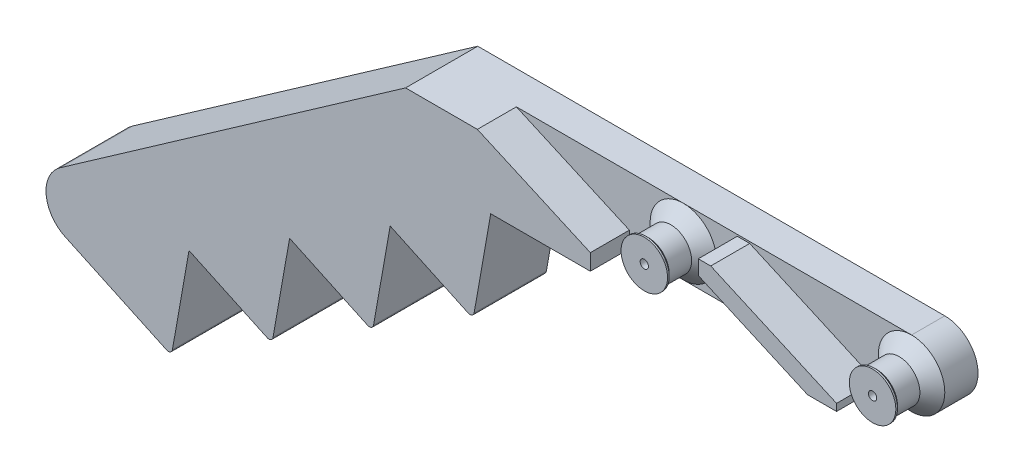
ISO-10303-21;
HEADER;
FILE_DESCRIPTION(('STEP AP214'),'2;1');
FILE_NAME('part.step','',(''),(''),'','','');
FILE_SCHEMA(('AUTOMOTIVE_DESIGN { 1 0 10303 214 1 1 1 1 }'));
ENDSEC;
DATA;
#1=APPLICATION_CONTEXT('core data for automotive mechanical design processes');
#2=APPLICATION_PROTOCOL_DEFINITION('international standard','automotive_design',2000,#1);
#3=PRODUCT_CONTEXT('',#1,'mechanical');
#4=PRODUCT('Part','Part','',(#3));
#5=PRODUCT_RELATED_PRODUCT_CATEGORY('part','',(#4));
#6=PRODUCT_DEFINITION_FORMATION('','',#4);
#7=PRODUCT_DEFINITION_CONTEXT('part definition',#1,'design');
#8=PRODUCT_DEFINITION('design','',#6,#7);
#9=PRODUCT_DEFINITION_SHAPE('','',#8);
#10=(LENGTH_UNIT() NAMED_UNIT(*) SI_UNIT(.MILLI.,.METRE.));
#11=(NAMED_UNIT(*) PLANE_ANGLE_UNIT() SI_UNIT($,.RADIAN.));
#12=(NAMED_UNIT(*) SI_UNIT($,.STERADIAN.) SOLID_ANGLE_UNIT());
#13=UNCERTAINTY_MEASURE_WITH_UNIT(LENGTH_MEASURE(1.E-05),#10,'distance_accuracy_value','');
#14=(GEOMETRIC_REPRESENTATION_CONTEXT(3) GLOBAL_UNCERTAINTY_ASSIGNED_CONTEXT((#13)) GLOBAL_UNIT_ASSIGNED_CONTEXT((#10,
#11,#12)) REPRESENTATION_CONTEXT('',''));
#15=CARTESIAN_POINT('',(0.,0.,0.));
#16=DIRECTION('',(0.,0.,1.));
#17=DIRECTION('',(1.,0.,0.));
#18=AXIS2_PLACEMENT_3D('',#15,#16,#17);
#19=CARTESIAN_POINT('',(-27.5,0.,4.));
#20=DIRECTION('',(0.,0.,1.));
#21=DIRECTION('',(1.,0.,0.));
#22=AXIS2_PLACEMENT_3D('',#19,#20,#21);
#23=PLANE('',#22);
#24=DIRECTION('',(0.,1.,0.));
#25=VECTOR('',#24,1.);
#26=CARTESIAN_POINT('',(-6.5,-3.8,4.));
#27=LINE('',#26,#25);
#28=CARTESIAN_POINT('',(-6.5,-4.,4.));
#29=VERTEX_POINT('',#28);
#30=CARTESIAN_POINT('',(-6.5,-2.0596432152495,4.));
#31=VERTEX_POINT('',#30);
#32=EDGE_CURVE('E411',#29,#31,#27,.T.);
#33=ORIENTED_EDGE('',*,*,#32,.F.);
#34=DIRECTION('',(1.,0.,0.));
#35=VECTOR('',#34,1.);
#36=CARTESIAN_POINT('',(-27.5,-4.,4.));
#37=LINE('',#36,#35);
#38=CARTESIAN_POINT('',(0.,-4.,4.));
#39=VERTEX_POINT('',#38);
#40=EDGE_CURVE('E317',#29,#39,#37,.T.);
#41=ORIENTED_EDGE('',*,*,#40,.T.);
#42=CARTESIAN_POINT('',(0.,0.,4.));
#43=DIRECTION('',(0.,0.,1.));
#44=DIRECTION('',(1.,0.,0.));
#45=AXIS2_PLACEMENT_3D('',#42,#43,#44);
#46=CIRCLE('',#45,4.);
#47=CARTESIAN_POINT('',(0.,4.,4.));
#48=VERTEX_POINT('',#47);
#49=EDGE_CURVE('E285',#48,#39,#46,.T.);
#50=ORIENTED_EDGE('',*,*,#49,.F.);
#51=DIRECTION('',(-1.,0.,0.));
#52=VECTOR('',#51,1.);
#53=CARTESIAN_POINT('',(-27.5,4.,4.));
#54=LINE('',#53,#52);
#55=CARTESIAN_POINT('',(-20.1101814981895,4.,4.));
#56=VERTEX_POINT('',#55);
#57=EDGE_CURVE('E318',#48,#56,#54,.T.);
#58=ORIENTED_EDGE('',*,*,#57,.T.);
#59=DIRECTION('',(-0.9135454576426,0.406736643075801,0.));
#60=VECTOR('',#59,1.);
#61=CARTESIAN_POINT('',(-6.5,-2.0596432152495,4.));
#62=LINE('',#61,#60);
#63=EDGE_CURVE('E435',#31,#56,#62,.T.);
#64=ORIENTED_EDGE('',*,*,#63,.F.);
#65=EDGE_LOOP('',(#33,#41,#50,#58,#64));
#66=FACE_BOUND('',#65,.T.);
#67=ADVANCED_FACE('F45',(#66),#23,.T.);
#68=CARTESIAN_POINT('',(-27.5,-4.,4.));
#69=DIRECTION('',(0.,1.,0.));
#70=DIRECTION('',(0.,0.,1.));
#71=AXIS2_PLACEMENT_3D('',#68,#69,#70);
#72=PLANE('',#71);
#73=DIRECTION('',(1.,0.,0.));
#74=VECTOR('',#73,1.);
#75=CARTESIAN_POINT('',(-27.5,-4.,0.));
#76=LINE('',#75,#74);
#77=CARTESIAN_POINT('',(-18.5,-4.,0.));
#78=VERTEX_POINT('',#77);
#79=CARTESIAN_POINT('',(27.5,-4.00000000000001,0.));
#80=VERTEX_POINT('',#79);
#81=EDGE_CURVE('E243',#78,#80,#76,.T.);
#82=ORIENTED_EDGE('',*,*,#81,.T.);
#83=DIRECTION('',(0.,0.,-1.));
#84=VECTOR('',#83,1.);
#85=CARTESIAN_POINT('',(27.5,-4.00000000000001,4.));
#86=LINE('',#85,#84);
#87=CARTESIAN_POINT('',(27.5,-4.00000000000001,4.));
#88=VERTEX_POINT('',#87);
#89=EDGE_CURVE('E271',#88,#80,#86,.T.);
#90=ORIENTED_EDGE('',*,*,#89,.F.);
#91=EDGE_CURVE('E267',#39,#88,#37,.T.);
#92=ORIENTED_EDGE('',*,*,#91,.F.);
#93=ORIENTED_EDGE('',*,*,#40,.F.);
#94=DIRECTION('',(0.,0.,-1.));
#95=VECTOR('',#94,1.);
#96=CARTESIAN_POINT('',(-6.5,-4.,86.4586234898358));
#97=LINE('',#96,#95);
#98=CARTESIAN_POINT('',(-6.5,-4.,8.7));
#99=VERTEX_POINT('',#98);
#100=EDGE_CURVE('E237',#99,#29,#97,.T.);
#101=ORIENTED_EDGE('',*,*,#100,.F.);
#102=DIRECTION('',(1.,0.,0.));
#103=VECTOR('',#102,1.);
#104=CARTESIAN_POINT('',(-6.5,-4.,8.7));
#105=LINE('',#104,#103);
#106=CARTESIAN_POINT('',(-18.5,-4.,8.7));
#107=VERTEX_POINT('',#106);
#108=EDGE_CURVE('E247',#107,#99,#105,.T.);
#109=ORIENTED_EDGE('',*,*,#108,.F.);
#110=DIRECTION('',(0.,0.,-1.));
#111=VECTOR('',#110,1.);
#112=CARTESIAN_POINT('',(-18.5,-4.,86.4586234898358));
#113=LINE('',#112,#111);
#114=EDGE_CURVE('E229',#107,#78,#113,.T.);
#115=ORIENTED_EDGE('',*,*,#114,.T.);
#116=EDGE_LOOP('',(#82,#90,#92,#93,#101,#109,#115));
#117=FACE_BOUND('',#116,.T.);
#118=ADVANCED_FACE('F241',(#117),#72,.F.);
#119=DIRECTION('',(1.,0.,0.));
#120=VECTOR('',#119,1.);
#121=CARTESIAN_POINT('',(19.6609741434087,-3.8,4.));
#122=LINE('',#121,#120);
#123=CARTESIAN_POINT('',(19.6609741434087,-3.8,4.));
#124=VERTEX_POINT('',#123);
#125=CARTESIAN_POINT('',(23.1609741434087,-3.8,4.));
#126=VERTEX_POINT('',#125);
#127=EDGE_CURVE('E396',#124,#126,#122,.T.);
#128=ORIENTED_EDGE('',*,*,#127,.F.);
#129=DIRECTION('',(0.9135454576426,-0.406736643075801,0.));
#130=VECTOR('',#129,1.);
#131=CARTESIAN_POINT('',(6.5,2.0596432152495,4.));
#132=LINE('',#131,#130);
#133=CARTESIAN_POINT('',(6.5,2.0596432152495,4.));
#134=VERTEX_POINT('',#133);
#135=EDGE_CURVE('E63',#134,#124,#132,.T.);
#136=ORIENTED_EDGE('',*,*,#135,.F.);
#137=DIRECTION('',(0.,-1.,0.));
#138=VECTOR('',#137,1.);
#139=CARTESIAN_POINT('',(6.5,3.8,4.));
#140=LINE('',#139,#138);
#141=CARTESIAN_POINT('',(6.5,3.8,4.));
#142=VERTEX_POINT('',#141);
#143=EDGE_CURVE('E68',#142,#134,#140,.T.);
#144=ORIENTED_EDGE('',*,*,#143,.F.);
#145=DIRECTION('',(-1.,0.,0.));
#146=VECTOR('',#145,1.);
#147=CARTESIAN_POINT('',(8.,3.8,4.));
#148=LINE('',#147,#146);
#149=CARTESIAN_POINT('',(8.,3.8,4.));
#150=VERTEX_POINT('',#149);
#151=EDGE_CURVE('E404',#150,#142,#148,.T.);
#152=ORIENTED_EDGE('',*,*,#151,.F.);
#153=DIRECTION('',(-0.9135454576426,0.406736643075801,0.));
#154=VECTOR('',#153,1.);
#155=CARTESIAN_POINT('',(23.1609741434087,-2.95010058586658,4.));
#156=LINE('',#155,#154);
#157=CARTESIAN_POINT('',(23.1609741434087,-2.95010058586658,4.));
#158=VERTEX_POINT('',#157);
#159=EDGE_CURVE('E388',#158,#150,#156,.T.);
#160=ORIENTED_EDGE('',*,*,#159,.F.);
#161=DIRECTION('',(0.,1.,0.));
#162=VECTOR('',#161,1.);
#163=CARTESIAN_POINT('',(23.1609741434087,-3.8,4.));
#164=LINE('',#163,#162);
#165=EDGE_CURVE('E392',#126,#158,#164,.T.);
#166=ORIENTED_EDGE('',*,*,#165,.F.);
#167=EDGE_LOOP('',(#128,#136,#144,#152,#160,#166));
#168=FACE_BOUND('',#167,.T.);
#169=ORIENTED_EDGE('',*,*,#91,.T.);
#170=CARTESIAN_POINT('',(27.5,0.,4.));
#171=DIRECTION('',(0.,0.,1.));
#172=DIRECTION('',(1.,0.,0.));
#173=AXIS2_PLACEMENT_3D('',#170,#171,#172);
#174=CIRCLE('',#173,4.);
#175=CARTESIAN_POINT('',(27.5,4.,4.));
#176=VERTEX_POINT('',#175);
#177=EDGE_CURVE('E273',#176,#88,#174,.T.);
#178=ORIENTED_EDGE('',*,*,#177,.F.);
#179=EDGE_CURVE('E263',#176,#48,#54,.T.);
#180=ORIENTED_EDGE('',*,*,#179,.T.);
#181=CARTESIAN_POINT('',(0.,0.,4.));
#182=DIRECTION('',(0.,0.,-1.));
#183=DIRECTION('',(-1.,0.,0.));
#184=AXIS2_PLACEMENT_3D('',#181,#182,#183);
#185=CIRCLE('',#184,4.);
#186=EDGE_CURVE('E313',#48,#39,#185,.T.);
#187=ORIENTED_EDGE('',*,*,#186,.T.);
#188=EDGE_LOOP('',(#169,#178,#180,#187));
#189=FACE_BOUND('',#188,.T.);
#190=ADVANCED_FACE('F326',(#168,#189),#23,.T.);
#191=CARTESIAN_POINT('',(27.5,0.,4.));
#192=DIRECTION('',(0.,0.,-1.));
#193=DIRECTION('',(-1.,0.,0.));
#194=AXIS2_PLACEMENT_3D('',#191,#192,#193);
#195=CYLINDRICAL_SURFACE('',#194,4.00000000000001);
#196=DIRECTION('',(0.,0.,-1.));
#197=VECTOR('',#196,1.);
#198=CARTESIAN_POINT('',(27.5,4.00000000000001,4.));
#199=LINE('',#198,#197);
#200=CARTESIAN_POINT('',(27.5,4.00000000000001,0.));
#201=VERTEX_POINT('',#200);
#202=EDGE_CURVE('E268',#176,#201,#199,.T.);
#203=ORIENTED_EDGE('',*,*,#202,.F.);
#204=CARTESIAN_POINT('',(27.5,0.,3.99999999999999));
#205=DIRECTION('',(0.,0.,1.));
#206=DIRECTION('',(1.,0.,0.));
#207=AXIS2_PLACEMENT_3D('',#204,#205,#206);
#208=CIRCLE('',#207,4.00000000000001);
#209=EDGE_CURVE('E276',#176,#88,#208,.F.);
#210=ORIENTED_EDGE('',*,*,#209,.T.);
#211=ORIENTED_EDGE('',*,*,#89,.T.);
#212=CARTESIAN_POINT('',(27.5,0.,0.));
#213=DIRECTION('',(0.,0.,1.));
#214=DIRECTION('',(1.,0.,0.));
#215=AXIS2_PLACEMENT_3D('',#212,#213,#214);
#216=CIRCLE('',#215,4.00000000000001);
#217=EDGE_CURVE('E254',#80,#201,#216,.T.);
#218=ORIENTED_EDGE('',*,*,#217,.T.);
#219=EDGE_LOOP('',(#203,#210,#211,#218));
#220=FACE_BOUND('',#219,.T.);
#221=ADVANCED_FACE('F333',(#220),#195,.T.);
#222=CARTESIAN_POINT('',(-27.5,4.,4.));
#223=DIRECTION('',(0.,-1.,0.));
#224=DIRECTION('',(1.,0.,0.));
#225=AXIS2_PLACEMENT_3D('',#222,#223,#224);
#226=PLANE('',#225);
#227=DIRECTION('',(0.,0.,-1.));
#228=VECTOR('',#227,1.);
#229=CARTESIAN_POINT('',(-20.1101814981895,4.,86.4586234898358));
#230=LINE('',#229,#228);
#231=CARTESIAN_POINT('',(-20.1101814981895,4.,8.7));
#232=VERTEX_POINT('',#231);
#233=EDGE_CURVE('E357',#232,#56,#230,.T.);
#234=ORIENTED_EDGE('',*,*,#233,.T.);
#235=ORIENTED_EDGE('',*,*,#57,.F.);
#236=ORIENTED_EDGE('',*,*,#179,.F.);
#237=ORIENTED_EDGE('',*,*,#202,.T.);
#238=DIRECTION('',(-1.,0.,0.));
#239=VECTOR('',#238,1.);
#240=CARTESIAN_POINT('',(-27.5,4.,0.));
#241=LINE('',#240,#239);
#242=CARTESIAN_POINT('',(-28.7611951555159,4.,0.));
#243=VERTEX_POINT('',#242);
#244=EDGE_CURVE('E257',#201,#243,#241,.T.);
#245=ORIENTED_EDGE('',*,*,#244,.T.);
#246=DIRECTION('',(0.,0.,-1.));
#247=VECTOR('',#246,1.);
#248=CARTESIAN_POINT('',(-28.7611951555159,4.,86.4586234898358));
#249=LINE('',#248,#247);
#250=CARTESIAN_POINT('',(-28.7611951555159,4.,8.7));
#251=VERTEX_POINT('',#250);
#252=EDGE_CURVE('E350',#251,#243,#249,.T.);
#253=ORIENTED_EDGE('',*,*,#252,.F.);
#254=DIRECTION('',(-1.,0.,0.));
#255=VECTOR('',#254,1.);
#256=CARTESIAN_POINT('',(-20.1101814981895,4.,8.7));
#257=LINE('',#256,#255);
#258=EDGE_CURVE('E450',#232,#251,#257,.T.);
#259=ORIENTED_EDGE('',*,*,#258,.F.);
#260=EDGE_LOOP('',(#234,#235,#236,#237,#245,#253,#259));
#261=FACE_BOUND('',#260,.T.);
#262=ADVANCED_FACE('F336',(#261),#226,.F.);
#263=CARTESIAN_POINT('',(-27.5,0.,0.));
#264=DIRECTION('',(0.,0.,1.));
#265=DIRECTION('',(1.,0.,0.));
#266=AXIS2_PLACEMENT_3D('',#263,#264,#265);
#267=PLANE('',#266);
#268=ORIENTED_EDGE('',*,*,#217,.F.);
#269=ORIENTED_EDGE('',*,*,#81,.F.);
#270=DIRECTION('',(-0.173648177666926,-0.984807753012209,0.));
#271=VECTOR('',#270,1.);
#272=CARTESIAN_POINT('',(-18.5,-4.,0.));
#273=LINE('',#272,#271);
#274=CARTESIAN_POINT('',(-20.5027724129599,-15.3582867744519,0.));
#275=VERTEX_POINT('',#274);
#276=EDGE_CURVE('E226',#78,#275,#273,.T.);
#277=ORIENTED_EDGE('',*,*,#276,.T.);
#278=CARTESIAN_POINT('',(-20.995176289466,-15.2714626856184,0.));
#279=DIRECTION('',(0.,0.,1.));
#280=DIRECTION('',(1.,0.,0.));
#281=AXIS2_PLACEMENT_3D('',#278,#279,#280);
#282=CIRCLE('',#281,0.499999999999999);
#283=CARTESIAN_POINT('',(-21.2064854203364,-15.7246165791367,0.));
#284=VERTEX_POINT('',#283);
#285=EDGE_CURVE('E238',#275,#284,#282,.F.);
#286=ORIENTED_EDGE('',*,*,#285,.T.);
#287=DIRECTION('',(-0.90630778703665,0.4226182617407,0.));
#288=VECTOR('',#287,1.);
#289=CARTESIAN_POINT('',(-21.2064854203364,-15.7246165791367,0.));
#290=LINE('',#289,#288);
#291=CARTESIAN_POINT('',(-30.6159237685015,-11.33692341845,0.));
#292=VERTEX_POINT('',#291);
#293=EDGE_CURVE('E947',#284,#292,#290,.T.);
#294=ORIENTED_EDGE('',*,*,#293,.T.);
#295=DIRECTION('',(-0.173648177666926,-0.984807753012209,0.));
#296=VECTOR('',#295,1.);
#297=CARTESIAN_POINT('',(-30.6159237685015,-11.33692341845,0.));
#298=LINE('',#297,#296);
#299=CARTESIAN_POINT('',(-32.6186961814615,-22.6952101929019,0.));
#300=VERTEX_POINT('',#299);
#301=EDGE_CURVE('E950',#292,#300,#298,.T.);
#302=ORIENTED_EDGE('',*,*,#301,.T.);
#303=CARTESIAN_POINT('',(-33.1111000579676,-22.6083861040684,0.));
#304=DIRECTION('',(0.,0.,1.));
#305=DIRECTION('',(1.,0.,0.));
#306=AXIS2_PLACEMENT_3D('',#303,#304,#305);
#307=CIRCLE('',#306,0.499999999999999);
#308=CARTESIAN_POINT('',(-33.3224091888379,-23.0615399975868,0.));
#309=VERTEX_POINT('',#308);
#310=EDGE_CURVE('E953',#300,#309,#307,.F.);
#311=ORIENTED_EDGE('',*,*,#310,.T.);
#312=DIRECTION('',(-0.90630778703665,0.4226182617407,0.));
#313=VECTOR('',#312,1.);
#314=CARTESIAN_POINT('',(-33.3224091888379,-23.0615399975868,0.));
#315=LINE('',#314,#313);
#316=CARTESIAN_POINT('',(-42.7318475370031,-18.6738468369,0.));
#317=VERTEX_POINT('',#316);
#318=EDGE_CURVE('E956',#309,#317,#315,.T.);
#319=ORIENTED_EDGE('',*,*,#318,.T.);
#320=DIRECTION('',(-0.173648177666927,-0.984807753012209,0.));
#321=VECTOR('',#320,1.);
#322=CARTESIAN_POINT('',(-42.7318475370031,-18.6738468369,0.));
#323=LINE('',#322,#321);
#324=CARTESIAN_POINT('',(-44.734619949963,-30.0321336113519,0.));
#325=VERTEX_POINT('',#324);
#326=EDGE_CURVE('E959',#317,#325,#323,.T.);
#327=ORIENTED_EDGE('',*,*,#326,.T.);
#328=CARTESIAN_POINT('',(-45.2270238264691,-29.9453095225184,0.));
#329=DIRECTION('',(0.,0.,1.));
#330=DIRECTION('',(1.,0.,0.));
#331=AXIS2_PLACEMENT_3D('',#328,#329,#330);
#332=CIRCLE('',#331,0.499999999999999);
#333=CARTESIAN_POINT('',(-45.4383329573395,-30.3984634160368,0.));
#334=VERTEX_POINT('',#333);
#335=EDGE_CURVE('E962',#325,#334,#332,.F.);
#336=ORIENTED_EDGE('',*,*,#335,.T.);
#337=DIRECTION('',(-0.90630778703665,0.4226182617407,0.));
#338=VECTOR('',#337,1.);
#339=CARTESIAN_POINT('',(-45.4383329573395,-30.3984634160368,0.));
#340=LINE('',#339,#338);
#341=CARTESIAN_POINT('',(-54.8477713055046,-26.01077025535,0.));
#342=VERTEX_POINT('',#341);
#343=EDGE_CURVE('E965',#334,#342,#340,.T.);
#344=ORIENTED_EDGE('',*,*,#343,.T.);
#345=DIRECTION('',(-0.173648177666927,-0.984807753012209,0.));
#346=VECTOR('',#345,1.);
#347=CARTESIAN_POINT('',(-54.8477713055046,-26.01077025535,0.));
#348=LINE('',#347,#346);
#349=CARTESIAN_POINT('',(-56.8505437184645,-37.3690570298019,0.));
#350=VERTEX_POINT('',#349);
#351=EDGE_CURVE('E968',#342,#350,#348,.T.);
#352=ORIENTED_EDGE('',*,*,#351,.T.);
#353=CARTESIAN_POINT('',(-57.3429475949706,-37.2822329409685,0.));
#354=DIRECTION('',(0.,0.,1.));
#355=DIRECTION('',(1.,0.,0.));
#356=AXIS2_PLACEMENT_3D('',#353,#354,#355);
#357=CIRCLE('',#356,0.500000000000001);
#358=CARTESIAN_POINT('',(-57.554256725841,-37.7353868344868,0.));
#359=VERTEX_POINT('',#358);
#360=EDGE_CURVE('E971',#350,#359,#357,.F.);
#361=ORIENTED_EDGE('',*,*,#360,.T.);
#362=DIRECTION('',(-0.90630778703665,0.4226182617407,0.));
#363=VECTOR('',#362,1.);
#364=CARTESIAN_POINT('',(-57.554256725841,-37.7353868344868,0.));
#365=LINE('',#364,#363);
#366=CARTESIAN_POINT('',(-69.7698031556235,-32.0391839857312,0.));
#367=VERTEX_POINT('',#366);
#368=EDGE_CURVE('E974',#359,#367,#365,.T.);
#369=ORIENTED_EDGE('',*,*,#368,.T.);
#370=CARTESIAN_POINT('',(-68.0793301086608,-28.4139528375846,0.));
#371=DIRECTION('',(0.,0.,1.));
#372=DIRECTION('',(1.,0.,0.));
#373=AXIS2_PLACEMENT_3D('',#370,#371,#372);
#374=CIRCLE('',#373,4.);
#375=CARTESIAN_POINT('',(-70.3736358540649,-25.1373446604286,0.));
#376=VERTEX_POINT('',#375);
#377=EDGE_CURVE('E345',#367,#376,#374,.F.);
#378=ORIENTED_EDGE('',*,*,#377,.T.);
#379=DIRECTION('',(0.819152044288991,0.573576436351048,0.));
#380=VECTOR('',#379,1.);
#381=CARTESIAN_POINT('',(-28.7611951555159,4.,0.));
#382=LINE('',#381,#380);
#383=EDGE_CURVE('E341',#376,#243,#382,.T.);
#384=ORIENTED_EDGE('',*,*,#383,.T.);
#385=ORIENTED_EDGE('',*,*,#244,.F.);
#386=EDGE_LOOP('',(#268,#269,#277,#286,#294,#302,#311,#319,#327,#336,#344,#352,#361,#369,#378,
#384,#385));
#387=FACE_BOUND('',#386,.T.);
#388=CARTESIAN_POINT('',(0.,0.,0.));
#389=DIRECTION('',(0.,0.,-1.));
#390=DIRECTION('',(-1.,0.,0.));
#391=AXIS2_PLACEMENT_3D('',#388,#389,#390);
#392=CIRCLE('',#391,0.5);
#393=CARTESIAN_POINT('',(-0.5,0.,0.));
#394=VERTEX_POINT('',#393);
#395=EDGE_CURVE('E297',#394,#394,#392,.T.);
#396=ORIENTED_EDGE('',*,*,#395,.F.);
#397=EDGE_LOOP('',(#396));
#398=FACE_BOUND('',#397,.T.);
#399=CARTESIAN_POINT('',(27.5,0.,0.));
#400=DIRECTION('',(0.,0.,-1.));
#401=DIRECTION('',(-1.,0.,0.));
#402=AXIS2_PLACEMENT_3D('',#399,#400,#401);
#403=CIRCLE('',#402,0.499999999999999);
#404=CARTESIAN_POINT('',(27.,0.,0.));
#405=VERTEX_POINT('',#404);
#406=EDGE_CURVE('E291',#405,#405,#403,.T.);
#407=ORIENTED_EDGE('',*,*,#406,.F.);
#408=EDGE_LOOP('',(#407));
#409=FACE_BOUND('',#408,.T.);
#410=ADVANCED_FACE('F251',(#387,#398,#409),#267,.F.);
#411=CARTESIAN_POINT('',(27.5,0.,7.5));
#412=DIRECTION('',(0.,0.,-1.));
#413=DIRECTION('',(-1.,0.,0.));
#414=AXIS2_PLACEMENT_3D('',#411,#412,#413);
#415=CYLINDRICAL_SURFACE('',#414,2.50000000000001);
#416=CARTESIAN_POINT('',(27.5,0.,8.20000000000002));
#417=DIRECTION('',(0.,0.,1.));
#418=DIRECTION('',(1.,0.,0.));
#419=AXIS2_PLACEMENT_3D('',#416,#417,#418);
#420=CIRCLE('',#419,2.50000000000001);
#421=CARTESIAN_POINT('',(30.,0.,8.20000000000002));
#422=VERTEX_POINT('',#421);
#423=EDGE_CURVE('E282',#422,#422,#420,.F.);
#424=ORIENTED_EDGE('',*,*,#423,.T.);
#425=EDGE_LOOP('',(#424));
#426=FACE_BOUND('',#425,.T.);
#427=CARTESIAN_POINT('',(27.5,0.,5.5));
#428=DIRECTION('',(0.,0.,-1.));
#429=DIRECTION('',(-1.,0.,0.));
#430=AXIS2_PLACEMENT_3D('',#427,#428,#429);
#431=CIRCLE('',#430,2.50000000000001);
#432=CARTESIAN_POINT('',(25.,0.,5.5));
#433=VERTEX_POINT('',#432);
#434=EDGE_CURVE('E255',#433,#433,#431,.T.);
#435=ORIENTED_EDGE('',*,*,#434,.F.);
#436=EDGE_LOOP('',(#435));
#437=FACE_BOUND('',#436,.T.);
#438=ADVANCED_FACE('F537',(#426,#437),#415,.T.);
#439=CARTESIAN_POINT('',(27.5,0.,8.7));
#440=DIRECTION('',(0.,0.,-1.));
#441=DIRECTION('',(-1.,0.,0.));
#442=AXIS2_PLACEMENT_3D('',#439,#440,#441);
#443=CYLINDRICAL_SURFACE('',#442,2.8);
#444=CARTESIAN_POINT('',(27.5,0.,8.50000000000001));
#445=DIRECTION('',(0.,0.,1.));
#446=DIRECTION('',(1.,0.,0.));
#447=AXIS2_PLACEMENT_3D('',#444,#445,#446);
#448=CIRCLE('',#447,2.8);
#449=CARTESIAN_POINT('',(30.3,0.,8.50000000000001));
#450=VERTEX_POINT('',#449);
#451=EDGE_CURVE('E279',#450,#450,#448,.T.);
#452=ORIENTED_EDGE('',*,*,#451,.T.);
#453=EDGE_LOOP('',(#452));
#454=FACE_BOUND('',#453,.T.);
#455=CARTESIAN_POINT('',(27.5,0.,8.7));
#456=DIRECTION('',(0.,0.,-1.));
#457=DIRECTION('',(-1.,0.,0.));
#458=AXIS2_PLACEMENT_3D('',#455,#456,#457);
#459=CIRCLE('',#458,2.8);
#460=CARTESIAN_POINT('',(24.7,0.,8.7));
#461=VERTEX_POINT('',#460);
#462=EDGE_CURVE('E260',#461,#461,#459,.T.);
#463=ORIENTED_EDGE('',*,*,#462,.T.);
#464=EDGE_LOOP('',(#463));
#465=FACE_BOUND('',#464,.T.);
#466=ADVANCED_FACE('F533',(#454,#465),#443,.T.);
#467=CARTESIAN_POINT('',(27.5,0.,8.7));
#468=DIRECTION('',(0.,0.,1.));
#469=DIRECTION('',(-1.,0.,0.));
#470=AXIS2_PLACEMENT_3D('',#467,#468,#469);
#471=PLANE('',#470);
#472=CARTESIAN_POINT('',(27.5,0.,8.7));
#473=DIRECTION('',(0.,0.,1.));
#474=DIRECTION('',(1.,0.,0.));
#475=AXIS2_PLACEMENT_3D('',#472,#473,#474);
#476=CIRCLE('',#475,0.499999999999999);
#477=CARTESIAN_POINT('',(28.,0.,8.7));
#478=VERTEX_POINT('',#477);
#479=EDGE_CURVE('E50',#478,#478,#476,.T.);
#480=ORIENTED_EDGE('',*,*,#479,.F.);
#481=EDGE_LOOP('',(#480));
#482=FACE_BOUND('',#481,.T.);
#483=ORIENTED_EDGE('',*,*,#462,.F.);
#484=EDGE_LOOP('',(#483));
#485=FACE_BOUND('',#484,.T.);
#486=ADVANCED_FACE('F531',(#482,#485),#471,.T.);
#487=CARTESIAN_POINT('',(27.5,0.,3.99999999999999));
#488=DIRECTION('',(0.,0.,-1.));
#489=DIRECTION('',(-1.,0.,0.));
#490=AXIS2_PLACEMENT_3D('',#487,#488,#489);
#491=CONICAL_SURFACE('',#490,4.00000000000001,0.785398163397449);
#492=ORIENTED_EDGE('',*,*,#434,.T.);
#493=EDGE_LOOP('',(#492));
#494=FACE_BOUND('',#493,.T.);
#495=ORIENTED_EDGE('',*,*,#177,.T.);
#496=ORIENTED_EDGE('',*,*,#209,.F.);
#497=EDGE_LOOP('',(#495,#496));
#498=FACE_BOUND('',#497,.T.);
#499=ADVANCED_FACE('F330',(#494,#498),#491,.T.);
#500=CARTESIAN_POINT('',(27.5,0.,7.5));
#501=DIRECTION('',(0.,0.,1.));
#502=DIRECTION('',(1.,0.,0.));
#503=AXIS2_PLACEMENT_3D('',#500,#501,#502);
#504=CONICAL_SURFACE('',#503,1.79999999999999,0.785398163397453);
#505=ORIENTED_EDGE('',*,*,#451,.F.);
#506=EDGE_LOOP('',(#505));
#507=FACE_BOUND('',#506,.T.);
#508=ORIENTED_EDGE('',*,*,#423,.F.);
#509=EDGE_LOOP('',(#508));
#510=FACE_BOUND('',#509,.T.);
#511=ADVANCED_FACE('F529',(#507,#510),#504,.T.);
#512=CARTESIAN_POINT('',(0.,0.,7.5));
#513=DIRECTION('',(0.,0.,-1.));
#514=DIRECTION('',(-1.,0.,0.));
#515=AXIS2_PLACEMENT_3D('',#512,#513,#514);
#516=CYLINDRICAL_SURFACE('',#515,2.50000000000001);
#517=CARTESIAN_POINT('',(0.,0.,8.20000000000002));
#518=DIRECTION('',(0.,0.,1.));
#519=DIRECTION('',(1.,0.,0.));
#520=AXIS2_PLACEMENT_3D('',#517,#518,#519);
#521=CIRCLE('',#520,2.50000000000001);
#522=CARTESIAN_POINT('',(2.50000000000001,0.,8.20000000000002));
#523=VERTEX_POINT('',#522);
#524=EDGE_CURVE('E11',#523,#523,#521,.F.);
#525=ORIENTED_EDGE('',*,*,#524,.T.);
#526=EDGE_LOOP('',(#525));
#527=FACE_BOUND('',#526,.T.);
#528=CARTESIAN_POINT('',(0.,0.,5.5));
#529=DIRECTION('',(0.,0.,-1.));
#530=DIRECTION('',(-1.,0.,0.));
#531=AXIS2_PLACEMENT_3D('',#528,#529,#530);
#532=CIRCLE('',#531,2.50000000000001);
#533=CARTESIAN_POINT('',(-2.50000000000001,0.,5.5));
#534=VERTEX_POINT('',#533);
#535=EDGE_CURVE('E310',#534,#534,#532,.T.);
#536=ORIENTED_EDGE('',*,*,#535,.F.);
#537=EDGE_LOOP('',(#536));
#538=FACE_BOUND('',#537,.T.);
#539=ADVANCED_FACE('F525',(#527,#538),#516,.T.);
#540=CARTESIAN_POINT('',(0.,0.,8.7));
#541=DIRECTION('',(0.,0.,-1.));
#542=DIRECTION('',(-1.,0.,0.));
#543=AXIS2_PLACEMENT_3D('',#540,#541,#542);
#544=CYLINDRICAL_SURFACE('',#543,2.8);
#545=CARTESIAN_POINT('',(0.,0.,8.50000000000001));
#546=DIRECTION('',(0.,0.,1.));
#547=DIRECTION('',(1.,0.,0.));
#548=AXIS2_PLACEMENT_3D('',#545,#546,#547);
#549=CIRCLE('',#548,2.8);
#550=CARTESIAN_POINT('',(2.8,0.,8.50000000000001));
#551=VERTEX_POINT('',#550);
#552=EDGE_CURVE('E55',#551,#551,#549,.T.);
#553=ORIENTED_EDGE('',*,*,#552,.T.);
#554=EDGE_LOOP('',(#553));
#555=FACE_BOUND('',#554,.T.);
#556=CARTESIAN_POINT('',(0.,0.,8.7));
#557=DIRECTION('',(0.,0.,-1.));
#558=DIRECTION('',(-1.,0.,0.));
#559=AXIS2_PLACEMENT_3D('',#556,#557,#558);
#560=CIRCLE('',#559,2.8);
#561=CARTESIAN_POINT('',(-2.8,0.,8.7));
#562=VERTEX_POINT('',#561);
#563=EDGE_CURVE('E295',#562,#562,#560,.T.);
#564=ORIENTED_EDGE('',*,*,#563,.T.);
#565=EDGE_LOOP('',(#564));
#566=FACE_BOUND('',#565,.T.);
#567=ADVANCED_FACE('F521',(#555,#566),#544,.T.);
#568=CARTESIAN_POINT('',(0.,0.,8.7));
#569=DIRECTION('',(0.,0.,1.));
#570=DIRECTION('',(-1.,0.,0.));
#571=AXIS2_PLACEMENT_3D('',#568,#569,#570);
#572=PLANE('',#571);
#573=CARTESIAN_POINT('',(0.,0.,8.7));
#574=DIRECTION('',(0.,0.,1.));
#575=DIRECTION('',(1.,0.,0.));
#576=AXIS2_PLACEMENT_3D('',#573,#574,#575);
#577=CIRCLE('',#576,0.5);
#578=CARTESIAN_POINT('',(0.5,0.,8.7));
#579=VERTEX_POINT('',#578);
#580=EDGE_CURVE('E289',#579,#579,#577,.T.);
#581=ORIENTED_EDGE('',*,*,#580,.F.);
#582=EDGE_LOOP('',(#581));
#583=FACE_BOUND('',#582,.T.);
#584=ORIENTED_EDGE('',*,*,#563,.F.);
#585=EDGE_LOOP('',(#584));
#586=FACE_BOUND('',#585,.T.);
#587=ADVANCED_FACE('F463',(#583,#586),#572,.T.);
#588=CARTESIAN_POINT('',(0.,0.,7.5));
#589=DIRECTION('',(0.,0.,1.));
#590=DIRECTION('',(1.,0.,0.));
#591=AXIS2_PLACEMENT_3D('',#588,#589,#590);
#592=CONICAL_SURFACE('',#591,1.79999999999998,0.785398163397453);
#593=ORIENTED_EDGE('',*,*,#552,.F.);
#594=EDGE_LOOP('',(#593));
#595=FACE_BOUND('',#594,.T.);
#596=ORIENTED_EDGE('',*,*,#524,.F.);
#597=EDGE_LOOP('',(#596));
#598=FACE_BOUND('',#597,.T.);
#599=ADVANCED_FACE('F454',(#595,#598),#592,.T.);
#600=CARTESIAN_POINT('',(0.,0.,4.00000000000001));
#601=DIRECTION('',(0.,0.,-1.));
#602=DIRECTION('',(-1.,0.,0.));
#603=AXIS2_PLACEMENT_3D('',#600,#601,#602);
#604=CONICAL_SURFACE('',#603,4.,0.785398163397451);
#605=ORIENTED_EDGE('',*,*,#535,.T.);
#606=EDGE_LOOP('',(#605));
#607=FACE_BOUND('',#606,.T.);
#608=ORIENTED_EDGE('',*,*,#49,.T.);
#609=ORIENTED_EDGE('',*,*,#186,.F.);
#610=EDGE_LOOP('',(#608,#609));
#611=FACE_BOUND('',#610,.T.);
#612=ADVANCED_FACE('F48',(#607,#611),#604,.T.);
#613=CARTESIAN_POINT('',(0.,0.,9.5));
#614=DIRECTION('',(0.,0.,-1.));
#615=DIRECTION('',(-1.,0.,0.));
#616=AXIS2_PLACEMENT_3D('',#613,#614,#615);
#617=CYLINDRICAL_SURFACE('',#616,0.5);
#618=ORIENTED_EDGE('',*,*,#580,.T.);
#619=EDGE_LOOP('',(#618));
#620=FACE_BOUND('',#619,.T.);
#621=ORIENTED_EDGE('',*,*,#395,.T.);
#622=EDGE_LOOP('',(#621));
#623=FACE_BOUND('',#622,.T.);
#624=ADVANCED_FACE('F453',(#620,#623),#617,.F.);
#625=CARTESIAN_POINT('',(27.5,0.,9.5));
#626=DIRECTION('',(0.,0.,-1.));
#627=DIRECTION('',(-1.,0.,0.));
#628=AXIS2_PLACEMENT_3D('',#625,#626,#627);
#629=CYLINDRICAL_SURFACE('',#628,0.499999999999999);
#630=ORIENTED_EDGE('',*,*,#479,.T.);
#631=EDGE_LOOP('',(#630));
#632=FACE_BOUND('',#631,.T.);
#633=ORIENTED_EDGE('',*,*,#406,.T.);
#634=EDGE_LOOP('',(#633));
#635=FACE_BOUND('',#634,.T.);
#636=ADVANCED_FACE('F461',(#632,#635),#629,.F.);
#637=CARTESIAN_POINT('',(-6.5,-3.8,27.0125110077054));
#638=DIRECTION('',(-1.,0.,0.));
#639=DIRECTION('',(0.,0.,1.));
#640=AXIS2_PLACEMENT_3D('',#637,#638,#639);
#641=PLANE('',#640);
#642=DIRECTION('',(0.,1.,0.));
#643=VECTOR('',#642,1.);
#644=CARTESIAN_POINT('',(-6.5,-3.8,8.7));
#645=LINE('',#644,#643);
#646=CARTESIAN_POINT('',(-6.5,-2.0596432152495,8.70000000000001));
#647=VERTEX_POINT('',#646);
#648=EDGE_CURVE('E437',#99,#647,#645,.T.);
#649=ORIENTED_EDGE('',*,*,#648,.F.);
#650=ORIENTED_EDGE('',*,*,#100,.T.);
#651=ORIENTED_EDGE('',*,*,#32,.T.);
#652=DIRECTION('',(0.,0.,-1.));
#653=VECTOR('',#652,1.);
#654=CARTESIAN_POINT('',(-6.5,-2.0596432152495,27.0125110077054));
#655=LINE('',#654,#653);
#656=EDGE_CURVE('E305',#647,#31,#655,.T.);
#657=ORIENTED_EDGE('',*,*,#656,.F.);
#658=EDGE_LOOP('',(#649,#650,#651,#657));
#659=FACE_BOUND('',#658,.T.);
#660=ADVANCED_FACE('F445',(#659),#641,.F.);
#661=CARTESIAN_POINT('',(-6.5,-2.0596432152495,27.0125110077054));
#662=DIRECTION('',(-0.406736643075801,-0.913545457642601,0.));
#663=DIRECTION('',(0.913545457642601,-0.406736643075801,0.));
#664=AXIS2_PLACEMENT_3D('',#661,#662,#663);
#665=PLANE('',#664);
#666=ORIENTED_EDGE('',*,*,#63,.T.);
#667=ORIENTED_EDGE('',*,*,#233,.F.);
#668=DIRECTION('',(-0.913545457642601,0.406736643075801,0.));
#669=VECTOR('',#668,1.);
#670=CARTESIAN_POINT('',(-6.5,-2.0596432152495,8.7));
#671=LINE('',#670,#669);
#672=EDGE_CURVE('E302',#647,#232,#671,.T.);
#673=ORIENTED_EDGE('',*,*,#672,.F.);
#674=ORIENTED_EDGE('',*,*,#656,.T.);
#675=EDGE_LOOP('',(#666,#667,#673,#674));
#676=FACE_BOUND('',#675,.T.);
#677=ADVANCED_FACE('F448',(#676),#665,.F.);
#678=CARTESIAN_POINT('',(27.5,0.,8.7));
#679=DIRECTION('',(0.,0.,1.));
#680=DIRECTION('',(-1.,0.,0.));
#681=AXIS2_PLACEMENT_3D('',#678,#679,#680);
#682=PLANE('',#681);
#683=DIRECTION('',(0.913545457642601,-0.406736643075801,0.));
#684=VECTOR('',#683,1.);
#685=CARTESIAN_POINT('',(6.5,2.0596432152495,8.7));
#686=LINE('',#685,#684);
#687=CARTESIAN_POINT('',(6.5,2.0596432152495,8.70000000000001));
#688=VERTEX_POINT('',#687);
#689=CARTESIAN_POINT('',(19.6609741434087,-3.8,8.70000000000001));
#690=VERTEX_POINT('',#689);
#691=EDGE_CURVE('E415',#688,#690,#686,.T.);
#692=ORIENTED_EDGE('',*,*,#691,.T.);
#693=DIRECTION('',(1.,0.,0.));
#694=VECTOR('',#693,1.);
#695=CARTESIAN_POINT('',(19.6609741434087,-3.8,8.7));
#696=LINE('',#695,#694);
#697=CARTESIAN_POINT('',(23.1609741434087,-3.8,8.70000000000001));
#698=VERTEX_POINT('',#697);
#699=EDGE_CURVE('E412',#690,#698,#696,.T.);
#700=ORIENTED_EDGE('',*,*,#699,.T.);
#701=DIRECTION('',(0.,1.,0.));
#702=VECTOR('',#701,1.);
#703=CARTESIAN_POINT('',(23.1609741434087,-3.8,8.7));
#704=LINE('',#703,#702);
#705=CARTESIAN_POINT('',(23.1609741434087,-2.95010058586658,8.70000000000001));
#706=VERTEX_POINT('',#705);
#707=EDGE_CURVE('E408',#698,#706,#704,.T.);
#708=ORIENTED_EDGE('',*,*,#707,.T.);
#709=DIRECTION('',(-0.9135454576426,0.406736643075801,0.));
#710=VECTOR('',#709,1.);
#711=CARTESIAN_POINT('',(23.1609741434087,-2.95010058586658,8.7));
#712=LINE('',#711,#710);
#713=CARTESIAN_POINT('',(8.,3.8,8.7));
#714=VERTEX_POINT('',#713);
#715=EDGE_CURVE('E390',#706,#714,#712,.T.);
#716=ORIENTED_EDGE('',*,*,#715,.T.);
#717=DIRECTION('',(-1.,0.,0.));
#718=VECTOR('',#717,1.);
#719=CARTESIAN_POINT('',(8.,3.8,8.7));
#720=LINE('',#719,#718);
#721=CARTESIAN_POINT('',(6.5,3.8,8.70000000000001));
#722=VERTEX_POINT('',#721);
#723=EDGE_CURVE('E420',#714,#722,#720,.T.);
#724=ORIENTED_EDGE('',*,*,#723,.T.);
#725=DIRECTION('',(0.,-1.,0.));
#726=VECTOR('',#725,1.);
#727=CARTESIAN_POINT('',(6.5,3.8,8.7));
#728=LINE('',#727,#726);
#729=EDGE_CURVE('E417',#722,#688,#728,.T.);
#730=ORIENTED_EDGE('',*,*,#729,.T.);
#731=EDGE_LOOP('',(#692,#700,#708,#716,#724,#730));
#732=FACE_BOUND('',#731,.T.);
#733=ADVANCED_FACE('F502',(#732),#682,.T.);
#734=CARTESIAN_POINT('',(23.1609741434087,-3.8,27.0125110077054));
#735=DIRECTION('',(-1.,0.,0.));
#736=DIRECTION('',(0.,0.,1.));
#737=AXIS2_PLACEMENT_3D('',#734,#735,#736);
#738=PLANE('',#737);
#739=ORIENTED_EDGE('',*,*,#707,.F.);
#740=DIRECTION('',(0.,0.,-1.));
#741=VECTOR('',#740,1.);
#742=CARTESIAN_POINT('',(23.1609741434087,-3.8,27.0125110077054));
#743=LINE('',#742,#741);
#744=EDGE_CURVE('E395',#698,#126,#743,.T.);
#745=ORIENTED_EDGE('',*,*,#744,.T.);
#746=ORIENTED_EDGE('',*,*,#165,.T.);
#747=DIRECTION('',(0.,0.,-1.));
#748=VECTOR('',#747,1.);
#749=CARTESIAN_POINT('',(23.1609741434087,-2.95010058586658,27.0125110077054));
#750=LINE('',#749,#748);
#751=EDGE_CURVE('E391',#706,#158,#750,.T.);
#752=ORIENTED_EDGE('',*,*,#751,.F.);
#753=EDGE_LOOP('',(#739,#745,#746,#752));
#754=FACE_BOUND('',#753,.T.);
#755=ADVANCED_FACE('F500',(#754),#738,.F.);
#756=CARTESIAN_POINT('',(19.6609741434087,-3.8,27.0125110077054));
#757=DIRECTION('',(0.,1.,0.));
#758=DIRECTION('',(-1.,0.,0.));
#759=AXIS2_PLACEMENT_3D('',#756,#757,#758);
#760=PLANE('',#759);
#761=ORIENTED_EDGE('',*,*,#699,.F.);
#762=DIRECTION('',(0.,0.,-1.));
#763=VECTOR('',#762,1.);
#764=CARTESIAN_POINT('',(19.6609741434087,-3.8,27.0125110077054));
#765=LINE('',#764,#763);
#766=EDGE_CURVE('E399',#690,#124,#765,.T.);
#767=ORIENTED_EDGE('',*,*,#766,.T.);
#768=ORIENTED_EDGE('',*,*,#127,.T.);
#769=ORIENTED_EDGE('',*,*,#744,.F.);
#770=EDGE_LOOP('',(#761,#767,#768,#769));
#771=FACE_BOUND('',#770,.T.);
#772=ADVANCED_FACE('F485',(#771),#760,.F.);
#773=CARTESIAN_POINT('',(6.5,2.0596432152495,27.0125110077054));
#774=DIRECTION('',(0.406736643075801,0.913545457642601,0.));
#775=DIRECTION('',(-0.913545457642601,0.406736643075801,0.));
#776=AXIS2_PLACEMENT_3D('',#773,#774,#775);
#777=PLANE('',#776);
#778=ORIENTED_EDGE('',*,*,#135,.T.);
#779=ORIENTED_EDGE('',*,*,#766,.F.);
#780=ORIENTED_EDGE('',*,*,#691,.F.);
#781=DIRECTION('',(0.,0.,-1.));
#782=VECTOR('',#781,1.);
#783=CARTESIAN_POINT('',(6.5,2.0596432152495,27.0125110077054));
#784=LINE('',#783,#782);
#785=EDGE_CURVE('E401',#688,#134,#784,.T.);
#786=ORIENTED_EDGE('',*,*,#785,.T.);
#787=EDGE_LOOP('',(#778,#779,#780,#786));
#788=FACE_BOUND('',#787,.T.);
#789=ADVANCED_FACE('F487',(#788),#777,.F.);
#790=CARTESIAN_POINT('',(23.1609741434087,-2.95010058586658,27.0125110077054));
#791=DIRECTION('',(-0.406736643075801,-0.9135454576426,0.));
#792=DIRECTION('',(0.9135454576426,-0.406736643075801,0.));
#793=AXIS2_PLACEMENT_3D('',#790,#791,#792);
#794=PLANE('',#793);
#795=DIRECTION('',(0.,0.,-1.));
#796=VECTOR('',#795,1.);
#797=CARTESIAN_POINT('',(8.,3.8,27.0125110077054));
#798=LINE('',#797,#796);
#799=EDGE_CURVE('E407',#714,#150,#798,.T.);
#800=ORIENTED_EDGE('',*,*,#799,.F.);
#801=ORIENTED_EDGE('',*,*,#715,.F.);
#802=ORIENTED_EDGE('',*,*,#751,.T.);
#803=ORIENTED_EDGE('',*,*,#159,.T.);
#804=EDGE_LOOP('',(#800,#801,#802,#803));
#805=FACE_BOUND('',#804,.T.);
#806=ADVANCED_FACE('F498',(#805),#794,.F.);
#807=CARTESIAN_POINT('',(8.,3.8,27.0125110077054));
#808=DIRECTION('',(0.,-1.,0.));
#809=DIRECTION('',(0.,0.,-1.));
#810=AXIS2_PLACEMENT_3D('',#807,#808,#809);
#811=PLANE('',#810);
#812=ORIENTED_EDGE('',*,*,#723,.F.);
#813=ORIENTED_EDGE('',*,*,#799,.T.);
#814=ORIENTED_EDGE('',*,*,#151,.T.);
#815=DIRECTION('',(0.,0.,-1.));
#816=VECTOR('',#815,1.);
#817=CARTESIAN_POINT('',(6.5,3.8,27.0125110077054));
#818=LINE('',#817,#816);
#819=EDGE_CURVE('E403',#722,#142,#818,.T.);
#820=ORIENTED_EDGE('',*,*,#819,.F.);
#821=EDGE_LOOP('',(#812,#813,#814,#820));
#822=FACE_BOUND('',#821,.T.);
#823=ADVANCED_FACE('F494',(#822),#811,.F.);
#824=CARTESIAN_POINT('',(6.5,3.8,27.0125110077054));
#825=DIRECTION('',(1.,0.,0.));
#826=DIRECTION('',(0.,0.,-1.));
#827=AXIS2_PLACEMENT_3D('',#824,#825,#826);
#828=PLANE('',#827);
#829=ORIENTED_EDGE('',*,*,#729,.F.);
#830=ORIENTED_EDGE('',*,*,#819,.T.);
#831=ORIENTED_EDGE('',*,*,#143,.T.);
#832=ORIENTED_EDGE('',*,*,#785,.F.);
#833=EDGE_LOOP('',(#829,#830,#831,#832));
#834=FACE_BOUND('',#833,.T.);
#835=ADVANCED_FACE('F490',(#834),#828,.F.);
#836=CARTESIAN_POINT('',(-18.5,-4.,86.4586234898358));
#837=DIRECTION('',(-0.984807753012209,0.173648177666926,0.));
#838=DIRECTION('',(-0.173648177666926,-0.984807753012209,0.));
#839=AXIS2_PLACEMENT_3D('',#836,#837,#838);
#840=PLANE('',#839);
#841=DIRECTION('',(0.173648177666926,0.984807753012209,0.));
#842=VECTOR('',#841,1.);
#843=CARTESIAN_POINT('',(-18.5,-4.,8.7));
#844=LINE('',#843,#842);
#845=CARTESIAN_POINT('',(-20.5027724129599,-15.3582867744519,8.7));
#846=VERTEX_POINT('',#845);
#847=EDGE_CURVE('E434',#846,#107,#844,.T.);
#848=ORIENTED_EDGE('',*,*,#847,.F.);
#849=DIRECTION('',(0.,0.,-1.));
#850=VECTOR('',#849,1.);
#851=CARTESIAN_POINT('',(-20.5027724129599,-15.3582867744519,86.4586234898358));
#852=LINE('',#851,#850);
#853=EDGE_CURVE('E232',#846,#275,#852,.T.);
#854=ORIENTED_EDGE('',*,*,#853,.T.);
#855=ORIENTED_EDGE('',*,*,#276,.F.);
#856=ORIENTED_EDGE('',*,*,#114,.F.);
#857=EDGE_LOOP('',(#848,#854,#855,#856));
#858=FACE_BOUND('',#857,.T.);
#859=ADVANCED_FACE('F228',(#858),#840,.F.);
#860=CARTESIAN_POINT('',(-20.995176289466,-15.2714626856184,86.4586234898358));
#861=DIRECTION('',(0.,0.,-1.));
#862=DIRECTION('',(-1.,0.,0.));
#863=AXIS2_PLACEMENT_3D('',#860,#861,#862);
#864=CYLINDRICAL_SURFACE('',#863,0.499999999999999);
#865=CARTESIAN_POINT('',(-20.995176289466,-15.2714626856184,8.7));
#866=DIRECTION('',(0.,0.,1.));
#867=DIRECTION('',(1.,0.,0.));
#868=AXIS2_PLACEMENT_3D('',#865,#866,#867);
#869=CIRCLE('',#868,0.499999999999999);
#870=CARTESIAN_POINT('',(-21.2064854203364,-15.7246165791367,8.7));
#871=VERTEX_POINT('',#870);
#872=EDGE_CURVE('E942',#871,#846,#869,.T.);
#873=ORIENTED_EDGE('',*,*,#872,.F.);
#874=DIRECTION('',(0.,0.,-1.));
#875=VECTOR('',#874,1.);
#876=CARTESIAN_POINT('',(-21.2064854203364,-15.7246165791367,86.4586234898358));
#877=LINE('',#876,#875);
#878=EDGE_CURVE('E383',#871,#284,#877,.T.);
#879=ORIENTED_EDGE('',*,*,#878,.T.);
#880=ORIENTED_EDGE('',*,*,#285,.F.);
#881=ORIENTED_EDGE('',*,*,#853,.F.);
#882=EDGE_LOOP('',(#873,#879,#880,#881));
#883=FACE_BOUND('',#882,.T.);
#884=ADVANCED_FACE('F562',(#883),#864,.T.);
#885=CARTESIAN_POINT('',(-21.2064854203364,-15.7246165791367,86.4586234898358));
#886=DIRECTION('',(0.422618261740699,0.90630778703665,0.));
#887=DIRECTION('',(-0.90630778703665,0.422618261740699,0.));
#888=AXIS2_PLACEMENT_3D('',#885,#886,#887);
#889=PLANE('',#888);
#890=DIRECTION('',(0.90630778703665,-0.422618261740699,0.));
#891=VECTOR('',#890,1.);
#892=CARTESIAN_POINT('',(-21.2064854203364,-15.7246165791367,8.7));
#893=LINE('',#892,#891);
#894=CARTESIAN_POINT('',(-30.6159237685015,-11.33692341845,8.7));
#895=VERTEX_POINT('',#894);
#896=EDGE_CURVE('E939',#895,#871,#893,.T.);
#897=ORIENTED_EDGE('',*,*,#896,.F.);
#898=DIRECTION('',(0.,0.,-1.));
#899=VECTOR('',#898,1.);
#900=CARTESIAN_POINT('',(-30.6159237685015,-11.33692341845,86.4586234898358));
#901=LINE('',#900,#899);
#902=EDGE_CURVE('E381',#895,#292,#901,.T.);
#903=ORIENTED_EDGE('',*,*,#902,.T.);
#904=ORIENTED_EDGE('',*,*,#293,.F.);
#905=ORIENTED_EDGE('',*,*,#878,.F.);
#906=EDGE_LOOP('',(#897,#903,#904,#905));
#907=FACE_BOUND('',#906,.T.);
#908=ADVANCED_FACE('F715',(#907),#889,.F.);
#909=CARTESIAN_POINT('',(-30.6159237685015,-11.33692341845,86.4586234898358));
#910=DIRECTION('',(-0.984807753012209,0.173648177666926,0.));
#911=DIRECTION('',(-0.173648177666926,-0.984807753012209,0.));
#912=AXIS2_PLACEMENT_3D('',#909,#910,#911);
#913=PLANE('',#912);
#914=DIRECTION('',(0.173648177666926,0.984807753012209,0.));
#915=VECTOR('',#914,1.);
#916=CARTESIAN_POINT('',(-30.6159237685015,-11.33692341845,8.7));
#917=LINE('',#916,#915);
#918=CARTESIAN_POINT('',(-32.6186961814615,-22.6952101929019,8.7));
#919=VERTEX_POINT('',#918);
#920=EDGE_CURVE('E936',#919,#895,#917,.T.);
#921=ORIENTED_EDGE('',*,*,#920,.F.);
#922=DIRECTION('',(0.,0.,-1.));
#923=VECTOR('',#922,1.);
#924=CARTESIAN_POINT('',(-32.6186961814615,-22.6952101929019,86.4586234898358));
#925=LINE('',#924,#923);
#926=EDGE_CURVE('E379',#919,#300,#925,.T.);
#927=ORIENTED_EDGE('',*,*,#926,.T.);
#928=ORIENTED_EDGE('',*,*,#301,.F.);
#929=ORIENTED_EDGE('',*,*,#902,.F.);
#930=EDGE_LOOP('',(#921,#927,#928,#929));
#931=FACE_BOUND('',#930,.T.);
#932=ADVANCED_FACE('F724',(#931),#913,.F.);
#933=CARTESIAN_POINT('',(-33.1111000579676,-22.6083861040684,86.4586234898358));
#934=DIRECTION('',(0.,0.,-1.));
#935=DIRECTION('',(-1.,0.,0.));
#936=AXIS2_PLACEMENT_3D('',#933,#934,#935);
#937=CYLINDRICAL_SURFACE('',#936,0.499999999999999);
#938=CARTESIAN_POINT('',(-33.1111000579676,-22.6083861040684,8.7));
#939=DIRECTION('',(0.,0.,1.));
#940=DIRECTION('',(1.,0.,0.));
#941=AXIS2_PLACEMENT_3D('',#938,#939,#940);
#942=CIRCLE('',#941,0.499999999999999);
#943=CARTESIAN_POINT('',(-33.3224091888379,-23.0615399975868,8.7));
#944=VERTEX_POINT('',#943);
#945=EDGE_CURVE('E933',#944,#919,#942,.T.);
#946=ORIENTED_EDGE('',*,*,#945,.F.);
#947=DIRECTION('',(0.,0.,-1.));
#948=VECTOR('',#947,1.);
#949=CARTESIAN_POINT('',(-33.3224091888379,-23.0615399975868,86.4586234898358));
#950=LINE('',#949,#948);
#951=EDGE_CURVE('E377',#944,#309,#950,.T.);
#952=ORIENTED_EDGE('',*,*,#951,.T.);
#953=ORIENTED_EDGE('',*,*,#310,.F.);
#954=ORIENTED_EDGE('',*,*,#926,.F.);
#955=EDGE_LOOP('',(#946,#952,#953,#954));
#956=FACE_BOUND('',#955,.T.);
#957=ADVANCED_FACE('F733',(#956),#937,.T.);
#958=CARTESIAN_POINT('',(-33.3224091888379,-23.0615399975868,86.4586234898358));
#959=DIRECTION('',(0.4226182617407,0.90630778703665,0.));
#960=DIRECTION('',(-0.90630778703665,0.4226182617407,0.));
#961=AXIS2_PLACEMENT_3D('',#958,#959,#960);
#962=PLANE('',#961);
#963=DIRECTION('',(0.90630778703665,-0.4226182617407,0.));
#964=VECTOR('',#963,1.);
#965=CARTESIAN_POINT('',(-33.3224091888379,-23.0615399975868,8.7));
#966=LINE('',#965,#964);
#967=CARTESIAN_POINT('',(-42.7318475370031,-18.6738468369,8.7));
#968=VERTEX_POINT('',#967);
#969=EDGE_CURVE('E930',#968,#944,#966,.T.);
#970=ORIENTED_EDGE('',*,*,#969,.F.);
#971=DIRECTION('',(0.,0.,-1.));
#972=VECTOR('',#971,1.);
#973=CARTESIAN_POINT('',(-42.7318475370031,-18.6738468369,86.4586234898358));
#974=LINE('',#973,#972);
#975=EDGE_CURVE('E375',#968,#317,#974,.T.);
#976=ORIENTED_EDGE('',*,*,#975,.T.);
#977=ORIENTED_EDGE('',*,*,#318,.F.);
#978=ORIENTED_EDGE('',*,*,#951,.F.);
#979=EDGE_LOOP('',(#970,#976,#977,#978));
#980=FACE_BOUND('',#979,.T.);
#981=ADVANCED_FACE('F742',(#980),#962,.F.);
#982=CARTESIAN_POINT('',(-42.7318475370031,-18.6738468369,86.4586234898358));
#983=DIRECTION('',(-0.984807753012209,0.173648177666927,0.));
#984=DIRECTION('',(-0.173648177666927,-0.984807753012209,0.));
#985=AXIS2_PLACEMENT_3D('',#982,#983,#984);
#986=PLANE('',#985);
#987=DIRECTION('',(0.173648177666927,0.984807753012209,0.));
#988=VECTOR('',#987,1.);
#989=CARTESIAN_POINT('',(-42.7318475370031,-18.6738468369,8.7));
#990=LINE('',#989,#988);
#991=CARTESIAN_POINT('',(-44.734619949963,-30.0321336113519,8.7));
#992=VERTEX_POINT('',#991);
#993=EDGE_CURVE('E927',#992,#968,#990,.T.);
#994=ORIENTED_EDGE('',*,*,#993,.F.);
#995=DIRECTION('',(0.,0.,-1.));
#996=VECTOR('',#995,1.);
#997=CARTESIAN_POINT('',(-44.734619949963,-30.0321336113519,86.4586234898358));
#998=LINE('',#997,#996);
#999=EDGE_CURVE('E373',#992,#325,#998,.T.);
#1000=ORIENTED_EDGE('',*,*,#999,.T.);
#1001=ORIENTED_EDGE('',*,*,#326,.F.);
#1002=ORIENTED_EDGE('',*,*,#975,.F.);
#1003=EDGE_LOOP('',(#994,#1000,#1001,#1002));
#1004=FACE_BOUND('',#1003,.T.);
#1005=ADVANCED_FACE('F751',(#1004),#986,.F.);
#1006=CARTESIAN_POINT('',(-45.2270238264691,-29.9453095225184,86.4586234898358));
#1007=DIRECTION('',(0.,0.,-1.));
#1008=DIRECTION('',(-1.,0.,0.));
#1009=AXIS2_PLACEMENT_3D('',#1006,#1007,#1008);
#1010=CYLINDRICAL_SURFACE('',#1009,0.499999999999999);
#1011=CARTESIAN_POINT('',(-45.2270238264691,-29.9453095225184,8.7));
#1012=DIRECTION('',(0.,0.,1.));
#1013=DIRECTION('',(1.,0.,0.));
#1014=AXIS2_PLACEMENT_3D('',#1011,#1012,#1013);
#1015=CIRCLE('',#1014,0.499999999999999);
#1016=CARTESIAN_POINT('',(-45.4383329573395,-30.3984634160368,8.7));
#1017=VERTEX_POINT('',#1016);
#1018=EDGE_CURVE('E924',#1017,#992,#1015,.T.);
#1019=ORIENTED_EDGE('',*,*,#1018,.F.);
#1020=DIRECTION('',(0.,0.,-1.));
#1021=VECTOR('',#1020,1.);
#1022=CARTESIAN_POINT('',(-45.4383329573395,-30.3984634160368,86.4586234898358));
#1023=LINE('',#1022,#1021);
#1024=EDGE_CURVE('E371',#1017,#334,#1023,.T.);
#1025=ORIENTED_EDGE('',*,*,#1024,.T.);
#1026=ORIENTED_EDGE('',*,*,#335,.F.);
#1027=ORIENTED_EDGE('',*,*,#999,.F.);
#1028=EDGE_LOOP('',(#1019,#1025,#1026,#1027));
#1029=FACE_BOUND('',#1028,.T.);
#1030=ADVANCED_FACE('F760',(#1029),#1010,.T.);
#1031=CARTESIAN_POINT('',(-45.4383329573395,-30.3984634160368,86.4586234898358));
#1032=DIRECTION('',(0.4226182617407,0.90630778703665,0.));
#1033=DIRECTION('',(-0.90630778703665,0.4226182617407,0.));
#1034=AXIS2_PLACEMENT_3D('',#1031,#1032,#1033);
#1035=PLANE('',#1034);
#1036=DIRECTION('',(0.90630778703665,-0.4226182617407,0.));
#1037=VECTOR('',#1036,1.);
#1038=CARTESIAN_POINT('',(-45.4383329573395,-30.3984634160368,8.7));
#1039=LINE('',#1038,#1037);
#1040=CARTESIAN_POINT('',(-54.8477713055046,-26.01077025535,8.7));
#1041=VERTEX_POINT('',#1040);
#1042=EDGE_CURVE('E921',#1041,#1017,#1039,.T.);
#1043=ORIENTED_EDGE('',*,*,#1042,.F.);
#1044=DIRECTION('',(0.,0.,-1.));
#1045=VECTOR('',#1044,1.);
#1046=CARTESIAN_POINT('',(-54.8477713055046,-26.01077025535,86.4586234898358));
#1047=LINE('',#1046,#1045);
#1048=EDGE_CURVE('E369',#1041,#342,#1047,.T.);
#1049=ORIENTED_EDGE('',*,*,#1048,.T.);
#1050=ORIENTED_EDGE('',*,*,#343,.F.);
#1051=ORIENTED_EDGE('',*,*,#1024,.F.);
#1052=EDGE_LOOP('',(#1043,#1049,#1050,#1051));
#1053=FACE_BOUND('',#1052,.T.);
#1054=ADVANCED_FACE('F769',(#1053),#1035,.F.);
#1055=CARTESIAN_POINT('',(-54.8477713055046,-26.01077025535,86.4586234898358));
#1056=DIRECTION('',(-0.984807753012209,0.173648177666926,0.));
#1057=DIRECTION('',(-0.173648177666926,-0.984807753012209,0.));
#1058=AXIS2_PLACEMENT_3D('',#1055,#1056,#1057);
#1059=PLANE('',#1058);
#1060=DIRECTION('',(0.173648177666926,0.984807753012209,0.));
#1061=VECTOR('',#1060,1.);
#1062=CARTESIAN_POINT('',(-54.8477713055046,-26.01077025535,8.7));
#1063=LINE('',#1062,#1061);
#1064=CARTESIAN_POINT('',(-56.8505437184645,-37.3690570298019,8.7));
#1065=VERTEX_POINT('',#1064);
#1066=EDGE_CURVE('E918',#1065,#1041,#1063,.T.);
#1067=ORIENTED_EDGE('',*,*,#1066,.F.);
#1068=DIRECTION('',(0.,0.,-1.));
#1069=VECTOR('',#1068,1.);
#1070=CARTESIAN_POINT('',(-56.8505437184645,-37.3690570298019,86.4586234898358));
#1071=LINE('',#1070,#1069);
#1072=EDGE_CURVE('E367',#1065,#350,#1071,.T.);
#1073=ORIENTED_EDGE('',*,*,#1072,.T.);
#1074=ORIENTED_EDGE('',*,*,#351,.F.);
#1075=ORIENTED_EDGE('',*,*,#1048,.F.);
#1076=EDGE_LOOP('',(#1067,#1073,#1074,#1075));
#1077=FACE_BOUND('',#1076,.T.);
#1078=ADVANCED_FACE('F778',(#1077),#1059,.F.);
#1079=CARTESIAN_POINT('',(-57.3429475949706,-37.2822329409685,86.4586234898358));
#1080=DIRECTION('',(0.,0.,-1.));
#1081=DIRECTION('',(-1.,0.,0.));
#1082=AXIS2_PLACEMENT_3D('',#1079,#1080,#1081);
#1083=CYLINDRICAL_SURFACE('',#1082,0.500000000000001);
#1084=CARTESIAN_POINT('',(-57.3429475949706,-37.2822329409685,8.7));
#1085=DIRECTION('',(0.,0.,1.));
#1086=DIRECTION('',(1.,0.,0.));
#1087=AXIS2_PLACEMENT_3D('',#1084,#1085,#1086);
#1088=CIRCLE('',#1087,0.500000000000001);
#1089=CARTESIAN_POINT('',(-57.554256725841,-37.7353868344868,8.7));
#1090=VERTEX_POINT('',#1089);
#1091=EDGE_CURVE('E910',#1090,#1065,#1088,.T.);
#1092=ORIENTED_EDGE('',*,*,#1091,.F.);
#1093=DIRECTION('',(0.,0.,-1.));
#1094=VECTOR('',#1093,1.);
#1095=CARTESIAN_POINT('',(-57.554256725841,-37.7353868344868,86.4586234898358));
#1096=LINE('',#1095,#1094);
#1097=EDGE_CURVE('E365',#1090,#359,#1096,.T.);
#1098=ORIENTED_EDGE('',*,*,#1097,.T.);
#1099=ORIENTED_EDGE('',*,*,#360,.F.);
#1100=ORIENTED_EDGE('',*,*,#1072,.F.);
#1101=EDGE_LOOP('',(#1092,#1098,#1099,#1100));
#1102=FACE_BOUND('',#1101,.T.);
#1103=ADVANCED_FACE('F787',(#1102),#1083,.T.);
#1104=CARTESIAN_POINT('',(-57.554256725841,-37.7353868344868,86.4586234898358));
#1105=DIRECTION('',(0.4226182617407,0.90630778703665,0.));
#1106=DIRECTION('',(-0.90630778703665,0.4226182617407,0.));
#1107=AXIS2_PLACEMENT_3D('',#1104,#1105,#1106);
#1108=PLANE('',#1107);
#1109=DIRECTION('',(0.90630778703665,-0.4226182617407,0.));
#1110=VECTOR('',#1109,1.);
#1111=CARTESIAN_POINT('',(-57.554256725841,-37.7353868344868,8.7));
#1112=LINE('',#1111,#1110);
#1113=CARTESIAN_POINT('',(-69.7698031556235,-32.0391839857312,8.7));
#1114=VERTEX_POINT('',#1113);
#1115=EDGE_CURVE('E905',#1114,#1090,#1112,.T.);
#1116=ORIENTED_EDGE('',*,*,#1115,.F.);
#1117=DIRECTION('',(0.,0.,-1.));
#1118=VECTOR('',#1117,1.);
#1119=CARTESIAN_POINT('',(-69.7698031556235,-32.0391839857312,86.4586234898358));
#1120=LINE('',#1119,#1118);
#1121=EDGE_CURVE('E359',#1114,#367,#1120,.T.);
#1122=ORIENTED_EDGE('',*,*,#1121,.T.);
#1123=ORIENTED_EDGE('',*,*,#368,.F.);
#1124=ORIENTED_EDGE('',*,*,#1097,.F.);
#1125=EDGE_LOOP('',(#1116,#1122,#1123,#1124));
#1126=FACE_BOUND('',#1125,.T.);
#1127=ADVANCED_FACE('F550',(#1126),#1108,.F.);
#1128=CARTESIAN_POINT('',(-68.0793301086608,-28.4139528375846,86.4586234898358));
#1129=DIRECTION('',(0.,0.,-1.));
#1130=DIRECTION('',(-1.,0.,0.));
#1131=AXIS2_PLACEMENT_3D('',#1128,#1129,#1130);
#1132=CYLINDRICAL_SURFACE('',#1131,4.);
#1133=CARTESIAN_POINT('',(-68.0793301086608,-28.4139528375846,8.7));
#1134=DIRECTION('',(0.,0.,1.));
#1135=DIRECTION('',(1.,0.,0.));
#1136=AXIS2_PLACEMENT_3D('',#1133,#1134,#1135);
#1137=CIRCLE('',#1136,4.);
#1138=CARTESIAN_POINT('',(-70.3736358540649,-25.1373446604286,8.7));
#1139=VERTEX_POINT('',#1138);
#1140=EDGE_CURVE('E911',#1139,#1114,#1137,.T.);
#1141=ORIENTED_EDGE('',*,*,#1140,.F.);
#1142=DIRECTION('',(0.,0.,-1.));
#1143=VECTOR('',#1142,1.);
#1144=CARTESIAN_POINT('',(-70.3736358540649,-25.1373446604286,86.4586234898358));
#1145=LINE('',#1144,#1143);
#1146=EDGE_CURVE('E356',#1139,#376,#1145,.T.);
#1147=ORIENTED_EDGE('',*,*,#1146,.T.);
#1148=ORIENTED_EDGE('',*,*,#377,.F.);
#1149=ORIENTED_EDGE('',*,*,#1121,.F.);
#1150=EDGE_LOOP('',(#1141,#1147,#1148,#1149));
#1151=FACE_BOUND('',#1150,.T.);
#1152=ADVANCED_FACE('F545',(#1151),#1132,.T.);
#1153=CARTESIAN_POINT('',(-28.7611951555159,4.,86.4586234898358));
#1154=DIRECTION('',(0.573576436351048,-0.819152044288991,0.));
#1155=DIRECTION('',(0.819152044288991,0.573576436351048,0.));
#1156=AXIS2_PLACEMENT_3D('',#1153,#1154,#1155);
#1157=PLANE('',#1156);
#1158=ORIENTED_EDGE('',*,*,#383,.F.);
#1159=ORIENTED_EDGE('',*,*,#1146,.F.);
#1160=DIRECTION('',(-0.819152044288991,-0.573576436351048,0.));
#1161=VECTOR('',#1160,1.);
#1162=CARTESIAN_POINT('',(-28.7611951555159,4.,8.7));
#1163=LINE('',#1162,#1161);
#1164=EDGE_CURVE('E353',#251,#1139,#1163,.T.);
#1165=ORIENTED_EDGE('',*,*,#1164,.F.);
#1166=ORIENTED_EDGE('',*,*,#252,.T.);
#1167=EDGE_LOOP('',(#1158,#1159,#1165,#1166));
#1168=FACE_BOUND('',#1167,.T.);
#1169=ADVANCED_FACE('F351',(#1168),#1157,.F.);
#1170=CARTESIAN_POINT('',(-27.5,0.,8.7));
#1171=DIRECTION('',(0.,0.,1.));
#1172=DIRECTION('',(1.,0.,0.));
#1173=AXIS2_PLACEMENT_3D('',#1170,#1171,#1172);
#1174=PLANE('',#1173);
#1175=ORIENTED_EDGE('',*,*,#108,.T.);
#1176=ORIENTED_EDGE('',*,*,#648,.T.);
#1177=ORIENTED_EDGE('',*,*,#672,.T.);
#1178=ORIENTED_EDGE('',*,*,#258,.T.);
#1179=ORIENTED_EDGE('',*,*,#1164,.T.);
#1180=ORIENTED_EDGE('',*,*,#1140,.T.);
#1181=ORIENTED_EDGE('',*,*,#1115,.T.);
#1182=ORIENTED_EDGE('',*,*,#1091,.T.);
#1183=ORIENTED_EDGE('',*,*,#1066,.T.);
#1184=ORIENTED_EDGE('',*,*,#1042,.T.);
#1185=ORIENTED_EDGE('',*,*,#1018,.T.);
#1186=ORIENTED_EDGE('',*,*,#993,.T.);
#1187=ORIENTED_EDGE('',*,*,#969,.T.);
#1188=ORIENTED_EDGE('',*,*,#945,.T.);
#1189=ORIENTED_EDGE('',*,*,#920,.T.);
#1190=ORIENTED_EDGE('',*,*,#896,.T.);
#1191=ORIENTED_EDGE('',*,*,#872,.T.);
#1192=ORIENTED_EDGE('',*,*,#847,.T.);
#1193=EDGE_LOOP('',(#1175,#1176,#1177,#1178,#1179,#1180,#1181,#1182,#1183,#1184,#1185,#1186,
#1187,#1188,#1189,#1190,#1191,#1192));
#1194=FACE_BOUND('',#1193,.T.);
#1195=ADVANCED_FACE('F442',(#1194),#1174,.T.);
#1196=CLOSED_SHELL('',(#67,#118,#190,#221,#262,#410,#438,#466,#486,#499,#511,#539,#567,#587,
#599,#612,#624,#636,#660,#677,#733,#755,#772,#789,#806,#823,#835,#859,#884,#908,#932,#957,#981,
#1005,#1030,#1054,#1078,#1103,#1127,#1152,#1169,#1195));
#1197=MANIFOLD_SOLID_BREP('B2',#1196);
#1198=ADVANCED_BREP_SHAPE_REPRESENTATION('',(#18,#1197),#14);
#1199=SHAPE_DEFINITION_REPRESENTATION(#9,#1198);
ENDSEC;
END-ISO-10303-21;
